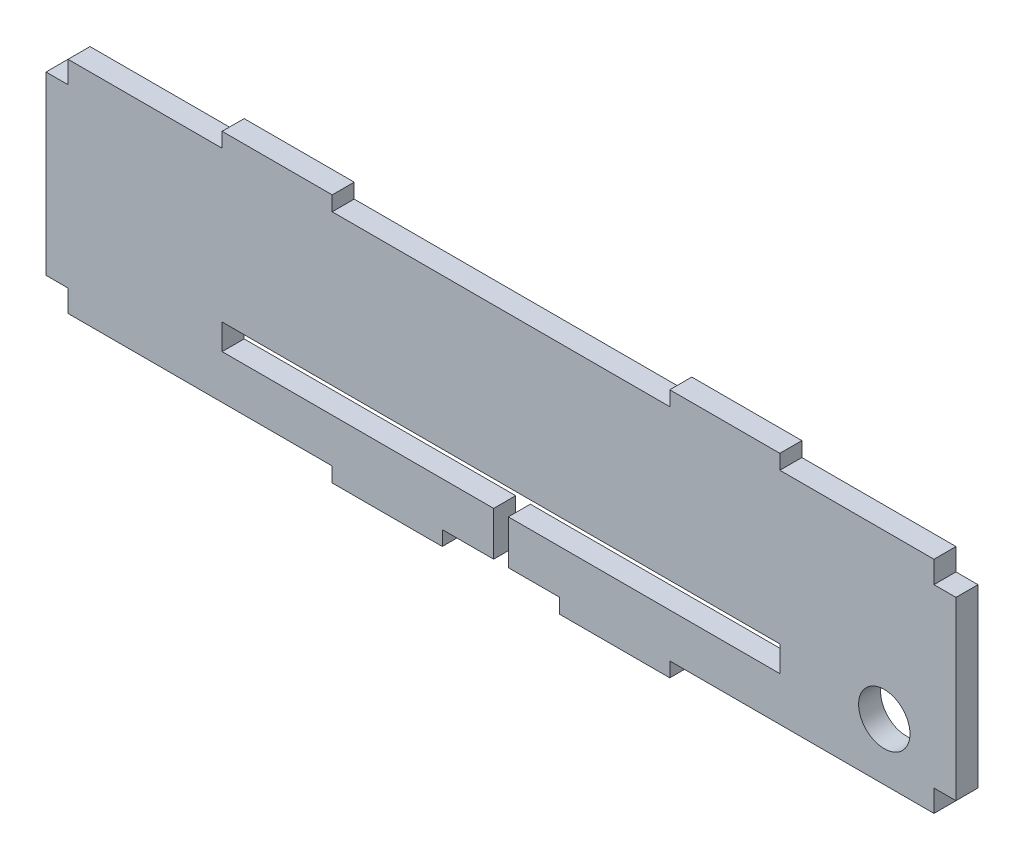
from build123d import *

# Parameters (mm, degrees)
SKETCH1_R           = 3.5
BOSS_EXTRUDE3_DEPTH = 3


with BuildPart() as part:
    # Sketch1 → Boss-Extrude3 (new body)
    with BuildSketch(Plane.XY):
        Polygon((6, 3), (6, 0), (42, 0), (42, -2), (57, -2), (57, 0), (64, 0), (64, 6), (27, 6), (27, 9.5), (103, 9.5), (103, 6), (66, 6), (66, 0), (73, 0), (73, -2), (88, -2), (88, 0), (124, 0), (124, 3), (127, 3), (127, 27), (124, 27), (124, 30), (103, 30), (103, 32), (88, 32), (88, 30), (42, 30), (42, 32), (27, 32), (27, 30), (6, 30), (6, 27), (3, 27), (3, 3), align=None)
        with Locations((117.228803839, 7.75)):
            Circle(SKETCH1_R, mode=Mode.SUBTRACT)
    extrude(amount=BOSS_EXTRUDE3_DEPTH)


solid = part.part
